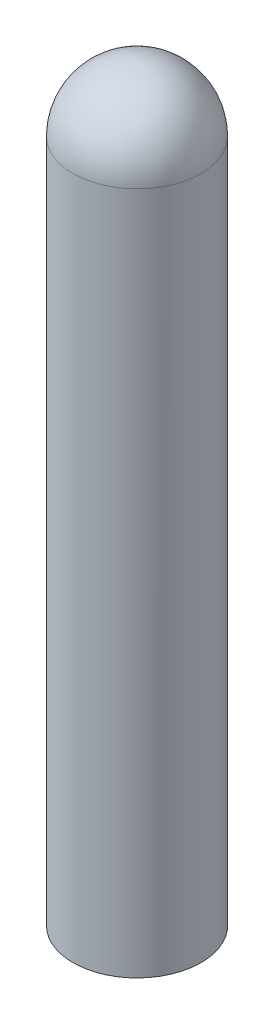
ISO-10303-21;
HEADER;
FILE_DESCRIPTION(('STEP AP214'),'2;1');
FILE_NAME('part.step','',(''),(''),'','','');
FILE_SCHEMA(('AUTOMOTIVE_DESIGN { 1 0 10303 214 1 1 1 1 }'));
ENDSEC;
DATA;
#1=APPLICATION_CONTEXT('core data for automotive mechanical design processes');
#2=APPLICATION_PROTOCOL_DEFINITION('international standard','automotive_design',2000,#1);
#3=PRODUCT_CONTEXT('',#1,'mechanical');
#4=PRODUCT('Part','Part','',(#3));
#5=PRODUCT_RELATED_PRODUCT_CATEGORY('part','',(#4));
#6=PRODUCT_DEFINITION_FORMATION('','',#4);
#7=PRODUCT_DEFINITION_CONTEXT('part definition',#1,'design');
#8=PRODUCT_DEFINITION('design','',#6,#7);
#9=PRODUCT_DEFINITION_SHAPE('','',#8);
#10=(LENGTH_UNIT() NAMED_UNIT(*) SI_UNIT(.MILLI.,.METRE.));
#11=(NAMED_UNIT(*) PLANE_ANGLE_UNIT() SI_UNIT($,.RADIAN.));
#12=(NAMED_UNIT(*) SI_UNIT($,.STERADIAN.) SOLID_ANGLE_UNIT());
#13=UNCERTAINTY_MEASURE_WITH_UNIT(LENGTH_MEASURE(1.E-05),#10,'distance_accuracy_value','');
#14=(GEOMETRIC_REPRESENTATION_CONTEXT(3) GLOBAL_UNCERTAINTY_ASSIGNED_CONTEXT((#13)) GLOBAL_UNIT_ASSIGNED_CONTEXT((#10,
#11,#12)) REPRESENTATION_CONTEXT('',''));
#15=CARTESIAN_POINT('',(0.,0.,0.));
#16=DIRECTION('',(0.,0.,1.));
#17=DIRECTION('',(1.,0.,0.));
#18=AXIS2_PLACEMENT_3D('',#15,#16,#17);
#19=CARTESIAN_POINT('',(0.,40.,0.));
#20=DIRECTION('',(0.,-1.,0.));
#21=DIRECTION('',(0.,0.,-1.));
#22=AXIS2_PLACEMENT_3D('',#19,#20,#21);
#23=CYLINDRICAL_SURFACE('',#22,3.75);
#24=CARTESIAN_POINT('',(0.,40.,0.));
#25=DIRECTION('',(0.,1.,0.));
#26=DIRECTION('',(0.,0.,1.));
#27=AXIS2_PLACEMENT_3D('',#24,#25,#26);
#28=CIRCLE('',#27,3.75);
#29=CARTESIAN_POINT('',(0.,40.,-3.75));
#30=VERTEX_POINT('',#29);
#31=EDGE_CURVE('E10',#30,#30,#28,.T.);
#32=CARTESIAN_POINT('',(0.,0.,0.));
#33=DIRECTION('',(0.,1.,0.));
#34=DIRECTION('',(0.,0.,1.));
#35=AXIS2_PLACEMENT_3D('',#32,#33,#34);
#36=CIRCLE('',#35,3.75);
#37=CARTESIAN_POINT('',(0.,0.,-3.75));
#38=VERTEX_POINT('',#37);
#39=EDGE_CURVE('E36',#38,#38,#36,.T.);
#40=CARTESIAN_POINT('',(0.,40.,-3.75));
#41=CARTESIAN_POINT('',(0.,39.5833333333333,-3.75));
#42=CARTESIAN_POINT('',(0.,39.1666666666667,-3.75));
#43=CARTESIAN_POINT('',(0.,38.3333333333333,-3.75));
#44=CARTESIAN_POINT('',(0.,37.9166666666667,-3.75));
#45=CARTESIAN_POINT('',(0.,37.0833333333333,-3.75));
#46=CARTESIAN_POINT('',(0.,36.6666666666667,-3.75));
#47=CARTESIAN_POINT('',(0.,35.8333333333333,-3.75));
#48=CARTESIAN_POINT('',(0.,35.4166666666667,-3.75));
#49=CARTESIAN_POINT('',(0.,34.5833333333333,-3.75));
#50=CARTESIAN_POINT('',(0.,34.1666666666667,-3.75));
#51=CARTESIAN_POINT('',(0.,33.3333333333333,-3.75));
#52=CARTESIAN_POINT('',(0.,32.9166666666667,-3.75));
#53=CARTESIAN_POINT('',(0.,32.0833333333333,-3.75));
#54=CARTESIAN_POINT('',(0.,31.6666666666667,-3.75));
#55=CARTESIAN_POINT('',(0.,30.8333333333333,-3.75));
#56=CARTESIAN_POINT('',(0.,30.4166666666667,-3.75));
#57=CARTESIAN_POINT('',(0.,29.5833333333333,-3.75));
#58=CARTESIAN_POINT('',(0.,29.1666666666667,-3.75));
#59=CARTESIAN_POINT('',(0.,28.3333333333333,-3.75));
#60=CARTESIAN_POINT('',(0.,27.9166666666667,-3.75));
#61=CARTESIAN_POINT('',(0.,27.0833333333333,-3.75));
#62=CARTESIAN_POINT('',(0.,26.6666666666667,-3.75));
#63=CARTESIAN_POINT('',(0.,25.8333333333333,-3.75));
#64=CARTESIAN_POINT('',(0.,25.4166666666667,-3.75));
#65=CARTESIAN_POINT('',(0.,24.5833333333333,-3.75));
#66=CARTESIAN_POINT('',(0.,24.1666666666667,-3.75));
#67=CARTESIAN_POINT('',(0.,23.3333333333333,-3.75));
#68=CARTESIAN_POINT('',(0.,22.9166666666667,-3.75));
#69=CARTESIAN_POINT('',(0.,22.0833333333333,-3.75));
#70=CARTESIAN_POINT('',(0.,21.6666666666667,-3.75));
#71=CARTESIAN_POINT('',(0.,20.8333333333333,-3.75));
#72=CARTESIAN_POINT('',(0.,20.4166666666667,-3.75));
#73=CARTESIAN_POINT('',(0.,19.5833333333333,-3.75));
#74=CARTESIAN_POINT('',(0.,19.1666666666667,-3.75));
#75=CARTESIAN_POINT('',(0.,18.3333333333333,-3.75));
#76=CARTESIAN_POINT('',(0.,17.9166666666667,-3.75));
#77=CARTESIAN_POINT('',(0.,17.0833333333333,-3.75));
#78=CARTESIAN_POINT('',(0.,16.6666666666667,-3.75));
#79=CARTESIAN_POINT('',(0.,15.8333333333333,-3.75));
#80=CARTESIAN_POINT('',(0.,15.4166666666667,-3.75));
#81=CARTESIAN_POINT('',(0.,14.5833333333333,-3.75));
#82=CARTESIAN_POINT('',(0.,14.1666666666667,-3.75));
#83=CARTESIAN_POINT('',(0.,13.3333333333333,-3.75));
#84=CARTESIAN_POINT('',(0.,12.9166666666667,-3.75));
#85=CARTESIAN_POINT('',(0.,12.0833333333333,-3.75));
#86=CARTESIAN_POINT('',(0.,11.6666666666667,-3.75));
#87=CARTESIAN_POINT('',(0.,10.8333333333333,-3.75));
#88=CARTESIAN_POINT('',(0.,10.4166666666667,-3.75));
#89=CARTESIAN_POINT('',(0.,9.58333333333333,-3.75));
#90=CARTESIAN_POINT('',(0.,9.16666666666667,-3.75));
#91=CARTESIAN_POINT('',(0.,8.33333333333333,-3.75));
#92=CARTESIAN_POINT('',(0.,7.91666666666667,-3.75));
#93=CARTESIAN_POINT('',(0.,7.08333333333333,-3.75));
#94=CARTESIAN_POINT('',(0.,6.66666666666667,-3.75));
#95=CARTESIAN_POINT('',(0.,5.83333333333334,-3.75));
#96=CARTESIAN_POINT('',(0.,5.41666666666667,-3.75));
#97=CARTESIAN_POINT('',(0.,4.58333333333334,-3.75));
#98=CARTESIAN_POINT('',(0.,4.16666666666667,-3.75));
#99=CARTESIAN_POINT('',(0.,3.33333333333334,-3.75));
#100=CARTESIAN_POINT('',(0.,2.91666666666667,-3.75));
#101=CARTESIAN_POINT('',(0.,2.08333333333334,-3.75));
#102=CARTESIAN_POINT('',(0.,1.66666666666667,-3.75));
#103=CARTESIAN_POINT('',(0.,0.833333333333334,-3.75));
#104=CARTESIAN_POINT('',(0.,0.416666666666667,-3.75));
#105=CARTESIAN_POINT('',(0.,0.,-3.75));
#106=B_SPLINE_CURVE_WITH_KNOTS('',3,(#40,#41,#42,#43,#44,#45,#46,#47,#48,#49,#50,#51,#52,#53,
#54,#55,#56,#57,#58,#59,#60,#61,#62,#63,#64,#65,#66,#67,#68,#69,#70,#71,#72,#73,#74,#75,#76,#77,
#78,#79,#80,#81,#82,#83,#84,#85,#86,#87,#88,#89,#90,#91,#92,#93,#94,#95,#96,#97,#98,#99,#100,
#101,#102,#103,#104,#105),.UNSPECIFIED.,.F.,.F.,(4,2,2,2,2,2,2,2,2,2,2,2,2,2,2,2,2,2,2,2,2,2,2,
2,2,2,2,2,2,2,2,2,4),(0.,1.24999999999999,2.5,3.75,5.,6.25,7.5,8.74999999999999,10.,11.25,12.5,
13.75,15.,16.25,17.5,18.75,20.,21.25,22.5,23.75,25.,26.25,27.5,28.75,30.,31.25,32.5,33.75,35.,
36.25,37.5,38.75,40.),.UNSPECIFIED.);
#107=EDGE_CURVE('BSEAM29',#30,#38,#106,.T.);
#108=ORIENTED_EDGE('',*,*,#31,.F.);
#109=ORIENTED_EDGE('',*,*,#39,.T.);
#110=ORIENTED_EDGE('',*,*,#107,.T.);
#111=ORIENTED_EDGE('',*,*,#107,.F.);
#112=EDGE_LOOP('',(#108,#110,#109,#111));
#113=FACE_BOUND('',#112,.T.);
#114=ADVANCED_FACE('F29',(#113),#23,.T.);
#115=CARTESIAN_POINT('',(0.,40.,0.));
#116=DIRECTION('',(0.,0.,1.));
#117=DIRECTION('',(1.,0.,0.));
#118=AXIS2_PLACEMENT_3D('',#115,#116,#117);
#119=SPHERICAL_SURFACE('',#118,3.75);
#120=CARTESIAN_POINT('',(0.,40.,0.));
#121=DIRECTION('',(0.,1.,0.));
#122=DIRECTION('',(0.,0.,1.));
#123=AXIS2_PLACEMENT_3D('',#120,#121,#122);
#124=SPHERICAL_SURFACE('',#123,3.75);
#125=ORIENTED_EDGE('',*,*,#31,.T.);
#126=EDGE_LOOP('',(#125));
#127=FACE_BOUND('',#126,.T.);
#128=ADVANCED_FACE('F31',(#127),#124,.T.);
#129=CARTESIAN_POINT('',(0.,0.,0.));
#130=DIRECTION('',(0.,1.,0.));
#131=DIRECTION('',(0.,0.,1.));
#132=AXIS2_PLACEMENT_3D('',#129,#130,#131);
#133=PLANE('',#132);
#134=ORIENTED_EDGE('',*,*,#39,.F.);
#135=EDGE_LOOP('',(#134));
#136=FACE_BOUND('',#135,.T.);
#137=ADVANCED_FACE('F43',(#136),#133,.F.);
#138=CLOSED_SHELL('',(#114,#128,#137));
#139=MANIFOLD_SOLID_BREP('B2',#138);
#140=ADVANCED_BREP_SHAPE_REPRESENTATION('',(#18,#139),#14);
#141=SHAPE_DEFINITION_REPRESENTATION(#9,#140);
ENDSEC;
END-ISO-10303-21;
